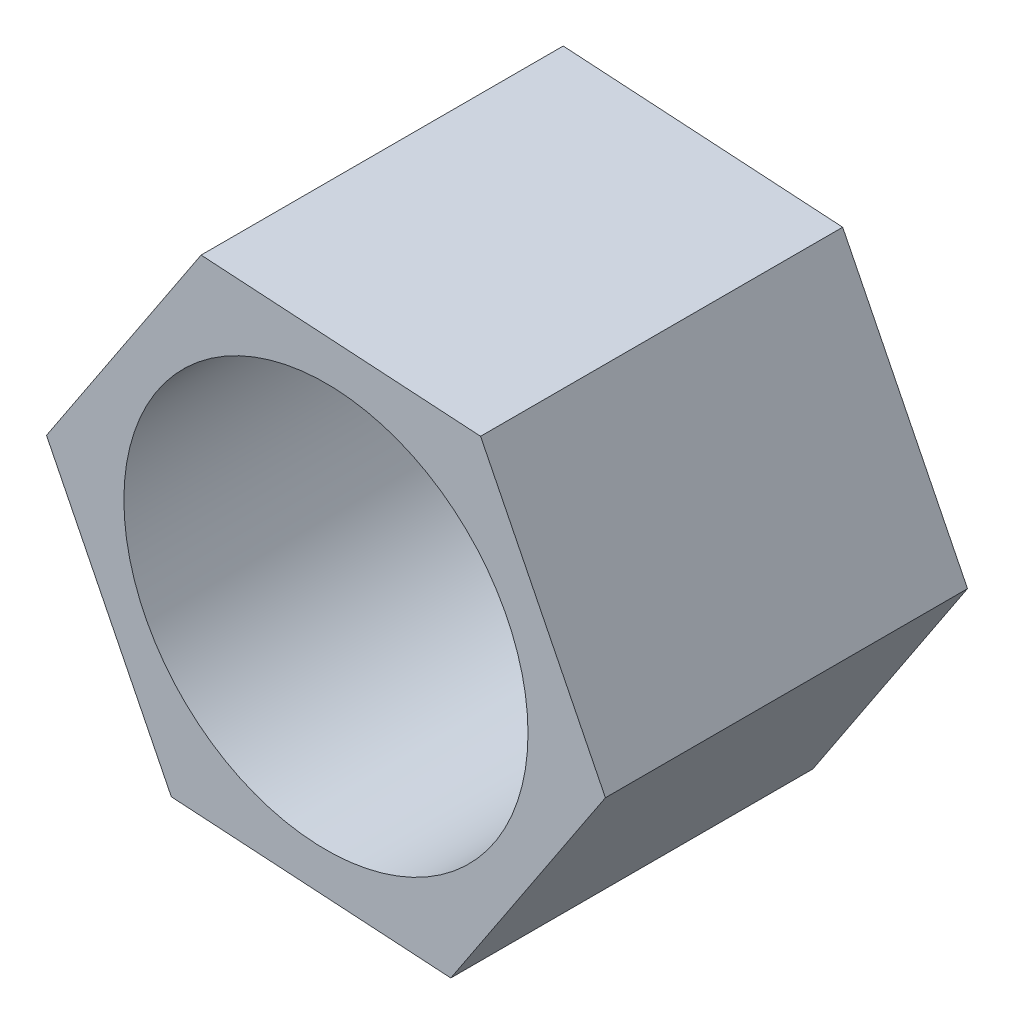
ISO-10303-21;
HEADER;
FILE_DESCRIPTION(('STEP AP214'),'2;1');
FILE_NAME('part.step','',(''),(''),'','','');
FILE_SCHEMA(('AUTOMOTIVE_DESIGN { 1 0 10303 214 1 1 1 1 }'));
ENDSEC;
DATA;
#1=APPLICATION_CONTEXT('core data for automotive mechanical design processes');
#2=APPLICATION_PROTOCOL_DEFINITION('international standard','automotive_design',2000,#1);
#3=PRODUCT_CONTEXT('',#1,'mechanical');
#4=PRODUCT('Part','Part','',(#3));
#5=PRODUCT_RELATED_PRODUCT_CATEGORY('part','',(#4));
#6=PRODUCT_DEFINITION_FORMATION('','',#4);
#7=PRODUCT_DEFINITION_CONTEXT('part definition',#1,'design');
#8=PRODUCT_DEFINITION('design','',#6,#7);
#9=PRODUCT_DEFINITION_SHAPE('','',#8);
#10=(LENGTH_UNIT() NAMED_UNIT(*) SI_UNIT(.MILLI.,.METRE.));
#11=(NAMED_UNIT(*) PLANE_ANGLE_UNIT() SI_UNIT($,.RADIAN.));
#12=(NAMED_UNIT(*) SI_UNIT($,.STERADIAN.) SOLID_ANGLE_UNIT());
#13=UNCERTAINTY_MEASURE_WITH_UNIT(LENGTH_MEASURE(1.E-05),#10,'distance_accuracy_value','');
#14=(GEOMETRIC_REPRESENTATION_CONTEXT(3) GLOBAL_UNCERTAINTY_ASSIGNED_CONTEXT((#13)) GLOBAL_UNIT_ASSIGNED_CONTEXT((#10,
#11,#12)) REPRESENTATION_CONTEXT('',''));
#15=CARTESIAN_POINT('',(0.,0.,0.));
#16=DIRECTION('',(0.,0.,1.));
#17=DIRECTION('',(1.,0.,0.));
#18=AXIS2_PLACEMENT_3D('',#15,#16,#17);
#19=CARTESIAN_POINT('',(6.91511944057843,-0.425585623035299,8.96));
#20=DIRECTION('',(-0.895103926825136,-0.445857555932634,0.));
#21=DIRECTION('',(0.445857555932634,-0.895103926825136,0.));
#22=AXIS2_PLACEMENT_3D('',#19,#20,#21);
#23=PLANE('',#22);
#24=DIRECTION('',(-0.445857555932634,0.895103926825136,0.));
#25=VECTOR('',#24,1.);
#26=CARTESIAN_POINT('',(6.91511944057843,-0.425585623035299,0.));
#27=LINE('',#26,#25);
#28=CARTESIAN_POINT('',(6.91511944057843,-0.425585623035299,0.));
#29=VERTEX_POINT('',#28);
#30=CARTESIAN_POINT('',(3.82612768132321,5.7758762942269,0.));
#31=VERTEX_POINT('',#30);
#32=EDGE_CURVE('E128',#29,#31,#27,.T.);
#33=ORIENTED_EDGE('',*,*,#32,.T.);
#34=DIRECTION('',(0.,0.,-1.));
#35=VECTOR('',#34,1.);
#36=CARTESIAN_POINT('',(3.82612768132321,5.7758762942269,8.96));
#37=LINE('',#36,#35);
#38=CARTESIAN_POINT('',(3.82612768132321,5.7758762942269,8.96));
#39=VERTEX_POINT('',#38);
#40=EDGE_CURVE('E11',#39,#31,#37,.T.);
#41=ORIENTED_EDGE('',*,*,#40,.F.);
#42=DIRECTION('',(-0.445857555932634,0.895103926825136,0.));
#43=VECTOR('',#42,1.);
#44=CARTESIAN_POINT('',(6.91511944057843,-0.425585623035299,8.96));
#45=LINE('',#44,#43);
#46=CARTESIAN_POINT('',(6.91511944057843,-0.425585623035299,8.96));
#47=VERTEX_POINT('',#46);
#48=EDGE_CURVE('E145',#47,#39,#45,.T.);
#49=ORIENTED_EDGE('',*,*,#48,.F.);
#50=DIRECTION('',(0.,0.,-1.));
#51=VECTOR('',#50,1.);
#52=CARTESIAN_POINT('',(6.91511944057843,-0.425585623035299,8.96));
#53=LINE('',#52,#51);
#54=EDGE_CURVE('E124',#47,#29,#53,.T.);
#55=ORIENTED_EDGE('',*,*,#54,.T.);
#56=EDGE_LOOP('',(#33,#41,#49,#55));
#57=FACE_BOUND('',#56,.T.);
#58=ADVANCED_FACE('F39',(#57),#23,.F.);
#59=CARTESIAN_POINT('',(3.82612768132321,5.7758762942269,8.96));
#60=DIRECTION('',(-0.0614279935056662,-0.998111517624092,0.));
#61=DIRECTION('',(0.998111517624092,-0.0614279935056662,0.));
#62=AXIS2_PLACEMENT_3D('',#59,#60,#61);
#63=PLANE('',#62);
#64=DIRECTION('',(-0.998111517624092,0.0614279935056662,0.));
#65=VECTOR('',#64,1.);
#66=CARTESIAN_POINT('',(3.82612768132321,5.7758762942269,0.));
#67=LINE('',#66,#65);
#68=CARTESIAN_POINT('',(-3.08899175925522,6.2014619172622,0.));
#69=VERTEX_POINT('',#68);
#70=EDGE_CURVE('E132',#31,#69,#67,.T.);
#71=ORIENTED_EDGE('',*,*,#70,.T.);
#72=DIRECTION('',(0.,0.,-1.));
#73=VECTOR('',#72,1.);
#74=CARTESIAN_POINT('',(-3.08899175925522,6.2014619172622,8.96));
#75=LINE('',#74,#73);
#76=CARTESIAN_POINT('',(-3.08899175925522,6.2014619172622,8.96));
#77=VERTEX_POINT('',#76);
#78=EDGE_CURVE('E48',#77,#69,#75,.T.);
#79=ORIENTED_EDGE('',*,*,#78,.F.);
#80=DIRECTION('',(-0.998111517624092,0.0614279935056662,0.));
#81=VECTOR('',#80,1.);
#82=CARTESIAN_POINT('',(3.82612768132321,5.7758762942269,8.96));
#83=LINE('',#82,#81);
#84=EDGE_CURVE('E93',#39,#77,#83,.T.);
#85=ORIENTED_EDGE('',*,*,#84,.F.);
#86=ORIENTED_EDGE('',*,*,#40,.T.);
#87=EDGE_LOOP('',(#71,#79,#85,#86));
#88=FACE_BOUND('',#87,.T.);
#89=ADVANCED_FACE('F174',(#88),#63,.F.);
#90=CARTESIAN_POINT('',(-3.08899175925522,6.2014619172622,8.96));
#91=DIRECTION('',(0.83367593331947,-0.552253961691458,0.));
#92=DIRECTION('',(0.552253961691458,0.83367593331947,0.));
#93=AXIS2_PLACEMENT_3D('',#90,#91,#92);
#94=PLANE('',#93);
#95=DIRECTION('',(-0.552253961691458,-0.83367593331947,0.));
#96=VECTOR('',#95,1.);
#97=CARTESIAN_POINT('',(-3.08899175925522,6.2014619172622,0.));
#98=LINE('',#97,#96);
#99=CARTESIAN_POINT('',(-6.91511944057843,0.425585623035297,0.));
#100=VERTEX_POINT('',#99);
#101=EDGE_CURVE('E136',#69,#100,#98,.T.);
#102=ORIENTED_EDGE('',*,*,#101,.T.);
#103=DIRECTION('',(0.,0.,-1.));
#104=VECTOR('',#103,1.);
#105=CARTESIAN_POINT('',(-6.91511944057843,0.425585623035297,8.96));
#106=LINE('',#105,#104);
#107=CARTESIAN_POINT('',(-6.91511944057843,0.425585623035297,8.96));
#108=VERTEX_POINT('',#107);
#109=EDGE_CURVE('E117',#108,#100,#106,.T.);
#110=ORIENTED_EDGE('',*,*,#109,.F.);
#111=DIRECTION('',(-0.552253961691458,-0.83367593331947,0.));
#112=VECTOR('',#111,1.);
#113=CARTESIAN_POINT('',(-3.08899175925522,6.2014619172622,8.96));
#114=LINE('',#113,#112);
#115=EDGE_CURVE('E106',#77,#108,#114,.T.);
#116=ORIENTED_EDGE('',*,*,#115,.F.);
#117=ORIENTED_EDGE('',*,*,#78,.T.);
#118=EDGE_LOOP('',(#102,#110,#116,#117));
#119=FACE_BOUND('',#118,.T.);
#120=ADVANCED_FACE('F155',(#119),#94,.F.);
#121=CARTESIAN_POINT('',(-6.91511944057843,0.425585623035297,8.96));
#122=DIRECTION('',(0.895103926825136,0.445857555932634,0.));
#123=DIRECTION('',(-0.445857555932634,0.895103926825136,0.));
#124=AXIS2_PLACEMENT_3D('',#121,#122,#123);
#125=PLANE('',#124);
#126=DIRECTION('',(0.445857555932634,-0.895103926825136,0.));
#127=VECTOR('',#126,1.);
#128=CARTESIAN_POINT('',(-6.91511944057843,0.425585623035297,0.));
#129=LINE('',#128,#127);
#130=CARTESIAN_POINT('',(-3.82612768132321,-5.7758762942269,0.));
#131=VERTEX_POINT('',#130);
#132=EDGE_CURVE('E115',#100,#131,#129,.T.);
#133=ORIENTED_EDGE('',*,*,#132,.T.);
#134=DIRECTION('',(0.,0.,-1.));
#135=VECTOR('',#134,1.);
#136=CARTESIAN_POINT('',(-3.82612768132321,-5.7758762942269,8.96));
#137=LINE('',#136,#135);
#138=CARTESIAN_POINT('',(-3.82612768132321,-5.7758762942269,8.96));
#139=VERTEX_POINT('',#138);
#140=EDGE_CURVE('E112',#139,#131,#137,.T.);
#141=ORIENTED_EDGE('',*,*,#140,.F.);
#142=DIRECTION('',(0.445857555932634,-0.895103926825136,0.));
#143=VECTOR('',#142,1.);
#144=CARTESIAN_POINT('',(-6.91511944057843,0.425585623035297,8.96));
#145=LINE('',#144,#143);
#146=EDGE_CURVE('E100',#108,#139,#145,.T.);
#147=ORIENTED_EDGE('',*,*,#146,.F.);
#148=ORIENTED_EDGE('',*,*,#109,.T.);
#149=EDGE_LOOP('',(#133,#141,#147,#148));
#150=FACE_BOUND('',#149,.T.);
#151=ADVANCED_FACE('F113',(#150),#125,.F.);
#152=CARTESIAN_POINT('',(-3.82612768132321,-5.7758762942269,8.96));
#153=DIRECTION('',(0.0614279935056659,0.998111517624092,0.));
#154=DIRECTION('',(-0.998111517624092,0.061427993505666,0.));
#155=AXIS2_PLACEMENT_3D('',#152,#153,#154);
#156=PLANE('',#155);
#157=DIRECTION('',(0.998111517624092,-0.0614279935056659,0.));
#158=VECTOR('',#157,1.);
#159=CARTESIAN_POINT('',(-3.82612768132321,-5.7758762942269,0.));
#160=LINE('',#159,#158);
#161=CARTESIAN_POINT('',(3.08899175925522,-6.2014619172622,0.));
#162=VERTEX_POINT('',#161);
#163=EDGE_CURVE('E79',#131,#162,#160,.T.);
#164=ORIENTED_EDGE('',*,*,#163,.T.);
#165=DIRECTION('',(0.,0.,-1.));
#166=VECTOR('',#165,1.);
#167=CARTESIAN_POINT('',(3.08899175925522,-6.2014619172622,8.96));
#168=LINE('',#167,#166);
#169=CARTESIAN_POINT('',(3.08899175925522,-6.2014619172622,8.96));
#170=VERTEX_POINT('',#169);
#171=EDGE_CURVE('E118',#170,#162,#168,.T.);
#172=ORIENTED_EDGE('',*,*,#171,.F.);
#173=DIRECTION('',(0.998111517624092,-0.0614279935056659,0.));
#174=VECTOR('',#173,1.);
#175=CARTESIAN_POINT('',(-3.82612768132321,-5.7758762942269,8.96));
#176=LINE('',#175,#174);
#177=EDGE_CURVE('E104',#139,#170,#176,.T.);
#178=ORIENTED_EDGE('',*,*,#177,.F.);
#179=ORIENTED_EDGE('',*,*,#140,.T.);
#180=EDGE_LOOP('',(#164,#172,#178,#179));
#181=FACE_BOUND('',#180,.T.);
#182=ADVANCED_FACE('F120',(#181),#156,.F.);
#183=CARTESIAN_POINT('',(3.08899175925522,-6.2014619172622,8.96));
#184=DIRECTION('',(-0.83367593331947,0.552253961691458,0.));
#185=DIRECTION('',(-0.552253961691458,-0.83367593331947,0.));
#186=AXIS2_PLACEMENT_3D('',#183,#184,#185);
#187=PLANE('',#186);
#188=DIRECTION('',(0.552253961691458,0.83367593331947,0.));
#189=VECTOR('',#188,1.);
#190=CARTESIAN_POINT('',(3.08899175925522,-6.2014619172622,0.));
#191=LINE('',#190,#189);
#192=EDGE_CURVE('E85',#162,#29,#191,.T.);
#193=ORIENTED_EDGE('',*,*,#192,.T.);
#194=ORIENTED_EDGE('',*,*,#54,.F.);
#195=DIRECTION('',(0.552253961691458,0.83367593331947,0.));
#196=VECTOR('',#195,1.);
#197=CARTESIAN_POINT('',(3.08899175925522,-6.2014619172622,8.96));
#198=LINE('',#197,#196);
#199=EDGE_CURVE('E56',#170,#47,#198,.T.);
#200=ORIENTED_EDGE('',*,*,#199,.F.);
#201=ORIENTED_EDGE('',*,*,#171,.T.);
#202=EDGE_LOOP('',(#193,#194,#200,#201));
#203=FACE_BOUND('',#202,.T.);
#204=ADVANCED_FACE('F162',(#203),#187,.F.);
#205=CARTESIAN_POINT('',(0.,0.,8.96));
#206=DIRECTION('',(0.,0.,1.));
#207=DIRECTION('',(1.,0.,0.));
#208=AXIS2_PLACEMENT_3D('',#205,#206,#207);
#209=PLANE('',#208);
#210=CARTESIAN_POINT('',(0.,0.,8.96));
#211=DIRECTION('',(0.,0.,1.));
#212=DIRECTION('',(1.,0.,0.));
#213=AXIS2_PLACEMENT_3D('',#210,#211,#212);
#214=CIRCLE('',#213,5.);
#215=CARTESIAN_POINT('',(5.,0.,8.96));
#216=VERTEX_POINT('',#215);
#217=EDGE_CURVE('E229',#216,#216,#214,.T.);
#218=ORIENTED_EDGE('',*,*,#217,.F.);
#219=EDGE_LOOP('',(#218));
#220=FACE_BOUND('',#219,.T.);
#221=ORIENTED_EDGE('',*,*,#48,.T.);
#222=ORIENTED_EDGE('',*,*,#84,.T.);
#223=ORIENTED_EDGE('',*,*,#115,.T.);
#224=ORIENTED_EDGE('',*,*,#146,.T.);
#225=ORIENTED_EDGE('',*,*,#177,.T.);
#226=ORIENTED_EDGE('',*,*,#199,.T.);
#227=EDGE_LOOP('',(#221,#222,#223,#224,#225,#226));
#228=FACE_BOUND('',#227,.T.);
#229=ADVANCED_FACE('F102',(#220,#228),#209,.T.);
#230=CARTESIAN_POINT('',(0.,0.,0.));
#231=DIRECTION('',(0.,0.,1.));
#232=DIRECTION('',(1.,0.,0.));
#233=AXIS2_PLACEMENT_3D('',#230,#231,#232);
#234=PLANE('',#233);
#235=CARTESIAN_POINT('',(0.,0.,0.));
#236=DIRECTION('',(0.,0.,1.));
#237=DIRECTION('',(1.,0.,0.));
#238=AXIS2_PLACEMENT_3D('',#235,#236,#237);
#239=CIRCLE('',#238,5.);
#240=CARTESIAN_POINT('',(5.,0.,0.));
#241=VERTEX_POINT('',#240);
#242=EDGE_CURVE('E133',#241,#241,#239,.T.);
#243=ORIENTED_EDGE('',*,*,#242,.T.);
#244=EDGE_LOOP('',(#243));
#245=FACE_BOUND('',#244,.T.);
#246=ORIENTED_EDGE('',*,*,#32,.F.);
#247=ORIENTED_EDGE('',*,*,#192,.F.);
#248=ORIENTED_EDGE('',*,*,#163,.F.);
#249=ORIENTED_EDGE('',*,*,#132,.F.);
#250=ORIENTED_EDGE('',*,*,#101,.F.);
#251=ORIENTED_EDGE('',*,*,#70,.F.);
#252=EDGE_LOOP('',(#246,#247,#248,#249,#250,#251));
#253=FACE_BOUND('',#252,.T.);
#254=ADVANCED_FACE('F158',(#245,#253),#234,.F.);
#255=CARTESIAN_POINT('',(0.,0.,0.));
#256=DIRECTION('',(0.,0.,1.));
#257=DIRECTION('',(1.,0.,0.));
#258=AXIS2_PLACEMENT_3D('',#255,#256,#257);
#259=CYLINDRICAL_SURFACE('',#258,5.);
#260=ORIENTED_EDGE('',*,*,#242,.F.);
#261=EDGE_LOOP('',(#260));
#262=FACE_BOUND('',#261,.T.);
#263=ORIENTED_EDGE('',*,*,#217,.T.);
#264=EDGE_LOOP('',(#263));
#265=FACE_BOUND('',#264,.T.);
#266=ADVANCED_FACE('F211',(#262,#265),#259,.F.);
#267=CLOSED_SHELL('',(#58,#89,#120,#151,#182,#204,#229,#254,#266));
#268=MANIFOLD_SOLID_BREP('B2',#267);
#269=ADVANCED_BREP_SHAPE_REPRESENTATION('',(#18,#268),#14);
#270=SHAPE_DEFINITION_REPRESENTATION(#9,#269);
ENDSEC;
END-ISO-10303-21;
